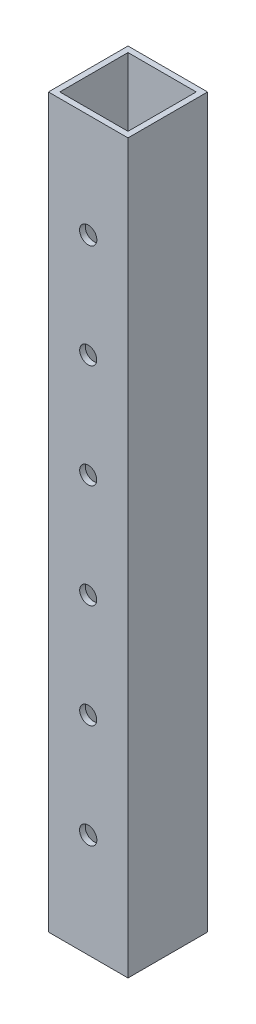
ISO-10303-21;
HEADER;
FILE_DESCRIPTION(('STEP AP214'),'2;1');
FILE_NAME('part.step','',(''),(''),'','','');
FILE_SCHEMA(('AUTOMOTIVE_DESIGN { 1 0 10303 214 1 1 1 1 }'));
ENDSEC;
DATA;
#1=APPLICATION_CONTEXT('core data for automotive mechanical design processes');
#2=APPLICATION_PROTOCOL_DEFINITION('international standard','automotive_design',2000,#1);
#3=PRODUCT_CONTEXT('',#1,'mechanical');
#4=PRODUCT('Part','Part','',(#3));
#5=PRODUCT_RELATED_PRODUCT_CATEGORY('part','',(#4));
#6=PRODUCT_DEFINITION_FORMATION('','',#4);
#7=PRODUCT_DEFINITION_CONTEXT('part definition',#1,'design');
#8=PRODUCT_DEFINITION('design','',#6,#7);
#9=PRODUCT_DEFINITION_SHAPE('','',#8);
#10=(LENGTH_UNIT() NAMED_UNIT(*) SI_UNIT(.MILLI.,.METRE.));
#11=(NAMED_UNIT(*) PLANE_ANGLE_UNIT() SI_UNIT($,.RADIAN.));
#12=(NAMED_UNIT(*) SI_UNIT($,.STERADIAN.) SOLID_ANGLE_UNIT());
#13=UNCERTAINTY_MEASURE_WITH_UNIT(LENGTH_MEASURE(1.E-05),#10,'distance_accuracy_value','');
#14=(GEOMETRIC_REPRESENTATION_CONTEXT(3) GLOBAL_UNCERTAINTY_ASSIGNED_CONTEXT((#13)) GLOBAL_UNIT_ASSIGNED_CONTEXT((#10,
#11,#12)) REPRESENTATION_CONTEXT('',''));
#15=CARTESIAN_POINT('',(0.,0.,0.));
#16=DIRECTION('',(0.,0.,1.));
#17=DIRECTION('',(1.,0.,0.));
#18=AXIS2_PLACEMENT_3D('',#15,#16,#17);
#19=CARTESIAN_POINT('',(-28.575,406.4,28.575));
#20=DIRECTION('',(0.,0.,-1.));
#21=DIRECTION('',(-1.,0.,0.));
#22=AXIS2_PLACEMENT_3D('',#19,#20,#21);
#23=PLANE('',#22);
#24=CARTESIAN_POINT('',(-6.35,58.0571428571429,28.575));
#25=DIRECTION('',(0.,0.,1.));
#26=DIRECTION('',(-1.,0.,0.));
#27=AXIS2_PLACEMENT_3D('',#24,#25,#26);
#28=CIRCLE('',#27,4.82600000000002);
#29=CARTESIAN_POINT('',(-11.176,58.0571428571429,28.575));
#30=VERTEX_POINT('',#29);
#31=EDGE_CURVE('E217',#30,#30,#28,.T.);
#32=ORIENTED_EDGE('',*,*,#31,.F.);
#33=EDGE_LOOP('',(#32));
#34=FACE_BOUND('',#33,.T.);
#35=DIRECTION('',(1.,0.,0.));
#36=VECTOR('',#35,1.);
#37=CARTESIAN_POINT('',(-28.575,0.,28.575));
#38=LINE('',#37,#36);
#39=CARTESIAN_POINT('',(-28.575,0.,28.575));
#40=VERTEX_POINT('',#39);
#41=CARTESIAN_POINT('',(15.875,0.,28.575));
#42=VERTEX_POINT('',#41);
#43=EDGE_CURVE('E184',#40,#42,#38,.T.);
#44=ORIENTED_EDGE('',*,*,#43,.T.);
#45=DIRECTION('',(0.,-1.,0.));
#46=VECTOR('',#45,1.);
#47=CARTESIAN_POINT('',(15.875,406.4,28.575));
#48=LINE('',#47,#46);
#49=CARTESIAN_POINT('',(15.875,406.4,28.575));
#50=VERTEX_POINT('',#49);
#51=EDGE_CURVE('E72',#50,#42,#48,.T.);
#52=ORIENTED_EDGE('',*,*,#51,.F.);
#53=DIRECTION('',(1.,0.,0.));
#54=VECTOR('',#53,1.);
#55=CARTESIAN_POINT('',(-28.575,406.4,28.575));
#56=LINE('',#55,#54);
#57=CARTESIAN_POINT('',(-28.575,406.4,28.575));
#58=VERTEX_POINT('',#57);
#59=EDGE_CURVE('E172',#58,#50,#56,.T.);
#60=ORIENTED_EDGE('',*,*,#59,.F.);
#61=DIRECTION('',(0.,-1.,0.));
#62=VECTOR('',#61,1.);
#63=CARTESIAN_POINT('',(-28.575,406.4,28.575));
#64=LINE('',#63,#62);
#65=EDGE_CURVE('E12',#58,#40,#64,.T.);
#66=ORIENTED_EDGE('',*,*,#65,.T.);
#67=EDGE_LOOP('',(#44,#52,#60,#66));
#68=FACE_BOUND('',#67,.T.);
#69=CARTESIAN_POINT('',(-6.35,290.285714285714,28.575));
#70=DIRECTION('',(0.,0.,-1.));
#71=DIRECTION('',(-1.,0.,0.));
#72=AXIS2_PLACEMENT_3D('',#69,#70,#71);
#73=CIRCLE('',#72,4.7625);
#74=CARTESIAN_POINT('',(-11.1125,290.285714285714,28.575));
#75=VERTEX_POINT('',#74);
#76=EDGE_CURVE('E199',#75,#75,#73,.T.);
#77=ORIENTED_EDGE('',*,*,#76,.T.);
#78=EDGE_LOOP('',(#77));
#79=FACE_BOUND('',#78,.T.);
#80=CARTESIAN_POINT('',(-6.35,348.342857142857,28.575));
#81=DIRECTION('',(0.,0.,-1.));
#82=DIRECTION('',(-1.,0.,0.));
#83=AXIS2_PLACEMENT_3D('',#80,#81,#82);
#84=CIRCLE('',#83,4.82600000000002);
#85=CARTESIAN_POINT('',(-11.176,348.342857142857,28.575));
#86=VERTEX_POINT('',#85);
#87=EDGE_CURVE('E204',#86,#86,#84,.T.);
#88=ORIENTED_EDGE('',*,*,#87,.T.);
#89=EDGE_LOOP('',(#88));
#90=FACE_BOUND('',#89,.T.);
#91=CARTESIAN_POINT('',(-6.35,232.228571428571,28.575));
#92=DIRECTION('',(0.,0.,-1.));
#93=DIRECTION('',(-1.,0.,0.));
#94=AXIS2_PLACEMENT_3D('',#91,#92,#93);
#95=CIRCLE('',#94,4.7625);
#96=CARTESIAN_POINT('',(-11.1125,232.228571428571,28.575));
#97=VERTEX_POINT('',#96);
#98=EDGE_CURVE('E209',#97,#97,#95,.T.);
#99=ORIENTED_EDGE('',*,*,#98,.T.);
#100=EDGE_LOOP('',(#99));
#101=FACE_BOUND('',#100,.T.);
#102=CARTESIAN_POINT('',(-6.35,116.114285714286,28.575));
#103=DIRECTION('',(0.,0.,1.));
#104=DIRECTION('',(-1.,0.,0.));
#105=AXIS2_PLACEMENT_3D('',#102,#103,#104);
#106=CIRCLE('',#105,4.7625);
#107=CARTESIAN_POINT('',(-11.1125,116.114285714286,28.575));
#108=VERTEX_POINT('',#107);
#109=EDGE_CURVE('E213',#108,#108,#106,.T.);
#110=ORIENTED_EDGE('',*,*,#109,.F.);
#111=EDGE_LOOP('',(#110));
#112=FACE_BOUND('',#111,.T.);
#113=CARTESIAN_POINT('',(-6.35,174.171428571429,28.575));
#114=DIRECTION('',(0.,0.,1.));
#115=DIRECTION('',(-1.,0.,0.));
#116=AXIS2_PLACEMENT_3D('',#113,#114,#115);
#117=CIRCLE('',#116,4.7625);
#118=CARTESIAN_POINT('',(-11.1125,174.171428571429,28.575));
#119=VERTEX_POINT('',#118);
#120=EDGE_CURVE('E277',#119,#119,#117,.T.);
#121=ORIENTED_EDGE('',*,*,#120,.F.);
#122=EDGE_LOOP('',(#121));
#123=FACE_BOUND('',#122,.T.);
#124=ADVANCED_FACE('F63',(#34,#68,#79,#90,#101,#112,#123),#23,.F.);
#125=CARTESIAN_POINT('',(-28.575,406.4,-15.875));
#126=DIRECTION('',(0.,0.,-1.));
#127=DIRECTION('',(-1.,0.,0.));
#128=AXIS2_PLACEMENT_3D('',#125,#126,#127);
#129=PLANE('',#128);
#130=CARTESIAN_POINT('',(-6.35,58.0571428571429,-15.875));
#131=DIRECTION('',(0.,0.,1.));
#132=DIRECTION('',(-1.,0.,0.));
#133=AXIS2_PLACEMENT_3D('',#130,#131,#132);
#134=CIRCLE('',#133,4.82600000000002);
#135=CARTESIAN_POINT('',(-11.176,58.0571428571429,-15.875));
#136=VERTEX_POINT('',#135);
#137=EDGE_CURVE('E224',#136,#136,#134,.T.);
#138=ORIENTED_EDGE('',*,*,#137,.T.);
#139=EDGE_LOOP('',(#138));
#140=FACE_BOUND('',#139,.T.);
#141=DIRECTION('',(1.,0.,0.));
#142=VECTOR('',#141,1.);
#143=CARTESIAN_POINT('',(-28.575,0.,-15.875));
#144=LINE('',#143,#142);
#145=CARTESIAN_POINT('',(-28.575,0.,-15.875));
#146=VERTEX_POINT('',#145);
#147=CARTESIAN_POINT('',(15.875,0.,-15.875));
#148=VERTEX_POINT('',#147);
#149=EDGE_CURVE('E173',#146,#148,#144,.T.);
#150=ORIENTED_EDGE('',*,*,#149,.F.);
#151=DIRECTION('',(0.,-1.,0.));
#152=VECTOR('',#151,1.);
#153=CARTESIAN_POINT('',(-28.575,406.4,-15.875));
#154=LINE('',#153,#152);
#155=CARTESIAN_POINT('',(-28.575,406.4,-15.875));
#156=VERTEX_POINT('',#155);
#157=EDGE_CURVE('E181',#156,#146,#154,.T.);
#158=ORIENTED_EDGE('',*,*,#157,.F.);
#159=DIRECTION('',(1.,0.,0.));
#160=VECTOR('',#159,1.);
#161=CARTESIAN_POINT('',(-28.575,406.4,-15.875));
#162=LINE('',#161,#160);
#163=CARTESIAN_POINT('',(15.875,406.4,-15.875));
#164=VERTEX_POINT('',#163);
#165=EDGE_CURVE('E178',#156,#164,#162,.T.);
#166=ORIENTED_EDGE('',*,*,#165,.T.);
#167=DIRECTION('',(0.,-1.,0.));
#168=VECTOR('',#167,1.);
#169=CARTESIAN_POINT('',(15.875,406.4,-15.875));
#170=LINE('',#169,#168);
#171=EDGE_CURVE('E193',#164,#148,#170,.T.);
#172=ORIENTED_EDGE('',*,*,#171,.T.);
#173=EDGE_LOOP('',(#150,#158,#166,#172));
#174=FACE_BOUND('',#173,.T.);
#175=CARTESIAN_POINT('',(-6.35,290.285714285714,-15.875));
#176=DIRECTION('',(0.,0.,-1.));
#177=DIRECTION('',(-1.,0.,0.));
#178=AXIS2_PLACEMENT_3D('',#175,#176,#177);
#179=CIRCLE('',#178,4.7625);
#180=CARTESIAN_POINT('',(-11.1125,290.285714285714,-15.875));
#181=VERTEX_POINT('',#180);
#182=EDGE_CURVE('E254',#181,#181,#179,.T.);
#183=ORIENTED_EDGE('',*,*,#182,.F.);
#184=EDGE_LOOP('',(#183));
#185=FACE_BOUND('',#184,.T.);
#186=CARTESIAN_POINT('',(-6.35,348.342857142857,-15.875));
#187=DIRECTION('',(0.,0.,-1.));
#188=DIRECTION('',(-1.,0.,0.));
#189=AXIS2_PLACEMENT_3D('',#186,#187,#188);
#190=CIRCLE('',#189,4.82600000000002);
#191=CARTESIAN_POINT('',(-11.176,348.342857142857,-15.875));
#192=VERTEX_POINT('',#191);
#193=EDGE_CURVE('E247',#192,#192,#190,.T.);
#194=ORIENTED_EDGE('',*,*,#193,.F.);
#195=EDGE_LOOP('',(#194));
#196=FACE_BOUND('',#195,.T.);
#197=CARTESIAN_POINT('',(-6.35,232.228571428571,-15.875));
#198=DIRECTION('',(0.,0.,-1.));
#199=DIRECTION('',(-1.,0.,0.));
#200=AXIS2_PLACEMENT_3D('',#197,#198,#199);
#201=CIRCLE('',#200,4.7625);
#202=CARTESIAN_POINT('',(-11.1125,232.228571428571,-15.875));
#203=VERTEX_POINT('',#202);
#204=EDGE_CURVE('E240',#203,#203,#201,.T.);
#205=ORIENTED_EDGE('',*,*,#204,.F.);
#206=EDGE_LOOP('',(#205));
#207=FACE_BOUND('',#206,.T.);
#208=CARTESIAN_POINT('',(-6.35,116.114285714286,-15.875));
#209=DIRECTION('',(0.,0.,1.));
#210=DIRECTION('',(-1.,0.,0.));
#211=AXIS2_PLACEMENT_3D('',#208,#209,#210);
#212=CIRCLE('',#211,4.7625);
#213=CARTESIAN_POINT('',(-11.1125,116.114285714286,-15.875));
#214=VERTEX_POINT('',#213);
#215=EDGE_CURVE('E221',#214,#214,#212,.T.);
#216=ORIENTED_EDGE('',*,*,#215,.T.);
#217=EDGE_LOOP('',(#216));
#218=FACE_BOUND('',#217,.T.);
#219=CARTESIAN_POINT('',(-6.35,174.171428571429,-15.875));
#220=DIRECTION('',(0.,0.,1.));
#221=DIRECTION('',(-1.,0.,0.));
#222=AXIS2_PLACEMENT_3D('',#219,#220,#221);
#223=CIRCLE('',#222,4.7625);
#224=CARTESIAN_POINT('',(-11.1125,174.171428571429,-15.875));
#225=VERTEX_POINT('',#224);
#226=EDGE_CURVE('E275',#225,#225,#223,.T.);
#227=ORIENTED_EDGE('',*,*,#226,.T.);
#228=EDGE_LOOP('',(#227));
#229=FACE_BOUND('',#228,.T.);
#230=ADVANCED_FACE('F262',(#140,#174,#185,#196,#207,#218,#229),#129,.T.);
#231=CARTESIAN_POINT('',(-25.4,406.4,-12.7));
#232=DIRECTION('',(0.,0.,-1.));
#233=DIRECTION('',(-1.,0.,0.));
#234=AXIS2_PLACEMENT_3D('',#231,#232,#233);
#235=PLANE('',#234);
#236=CARTESIAN_POINT('',(-6.35,58.0571428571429,-12.7));
#237=DIRECTION('',(0.,0.,-1.));
#238=DIRECTION('',(-1.,0.,0.));
#239=AXIS2_PLACEMENT_3D('',#236,#237,#238);
#240=CIRCLE('',#239,4.82600000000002);
#241=CARTESIAN_POINT('',(-11.176,58.0571428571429,-12.7));
#242=VERTEX_POINT('',#241);
#243=EDGE_CURVE('E216',#242,#242,#240,.F.);
#244=ORIENTED_EDGE('',*,*,#243,.F.);
#245=EDGE_LOOP('',(#244));
#246=FACE_BOUND('',#245,.T.);
#247=DIRECTION('',(1.,0.,0.));
#248=VECTOR('',#247,1.);
#249=CARTESIAN_POINT('',(-25.4,0.,-12.7));
#250=LINE('',#249,#248);
#251=CARTESIAN_POINT('',(-25.4,0.,-12.7));
#252=VERTEX_POINT('',#251);
#253=CARTESIAN_POINT('',(12.7,0.,-12.7));
#254=VERTEX_POINT('',#253);
#255=EDGE_CURVE('E88',#252,#254,#250,.T.);
#256=ORIENTED_EDGE('',*,*,#255,.T.);
#257=DIRECTION('',(0.,-1.,0.));
#258=VECTOR('',#257,1.);
#259=CARTESIAN_POINT('',(12.7,406.4,-12.7));
#260=LINE('',#259,#258);
#261=CARTESIAN_POINT('',(12.7,406.4,-12.7));
#262=VERTEX_POINT('',#261);
#263=EDGE_CURVE('E129',#262,#254,#260,.T.);
#264=ORIENTED_EDGE('',*,*,#263,.F.);
#265=DIRECTION('',(1.,0.,0.));
#266=VECTOR('',#265,1.);
#267=CARTESIAN_POINT('',(-25.4,406.4,-12.7));
#268=LINE('',#267,#266);
#269=CARTESIAN_POINT('',(-25.4,406.4,-12.7));
#270=VERTEX_POINT('',#269);
#271=EDGE_CURVE('E133',#270,#262,#268,.T.);
#272=ORIENTED_EDGE('',*,*,#271,.F.);
#273=DIRECTION('',(0.,-1.,0.));
#274=VECTOR('',#273,1.);
#275=CARTESIAN_POINT('',(-25.4,406.4,-12.7));
#276=LINE('',#275,#274);
#277=EDGE_CURVE('E163',#270,#252,#276,.T.);
#278=ORIENTED_EDGE('',*,*,#277,.T.);
#279=EDGE_LOOP('',(#256,#264,#272,#278));
#280=FACE_BOUND('',#279,.T.);
#281=CARTESIAN_POINT('',(-6.35,290.285714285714,-12.7));
#282=DIRECTION('',(0.,0.,-1.));
#283=DIRECTION('',(-1.,0.,0.));
#284=AXIS2_PLACEMENT_3D('',#281,#282,#283);
#285=CIRCLE('',#284,4.7625);
#286=CARTESIAN_POINT('',(-11.1125,290.285714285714,-12.7));
#287=VERTEX_POINT('',#286);
#288=EDGE_CURVE('E153',#287,#287,#285,.T.);
#289=ORIENTED_EDGE('',*,*,#288,.T.);
#290=EDGE_LOOP('',(#289));
#291=FACE_BOUND('',#290,.T.);
#292=CARTESIAN_POINT('',(-6.35,348.342857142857,-12.7));
#293=DIRECTION('',(0.,0.,-1.));
#294=DIRECTION('',(-1.,0.,0.));
#295=AXIS2_PLACEMENT_3D('',#292,#293,#294);
#296=CIRCLE('',#295,4.82600000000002);
#297=CARTESIAN_POINT('',(-11.176,348.342857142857,-12.7));
#298=VERTEX_POINT('',#297);
#299=EDGE_CURVE('E203',#298,#298,#296,.T.);
#300=ORIENTED_EDGE('',*,*,#299,.T.);
#301=EDGE_LOOP('',(#300));
#302=FACE_BOUND('',#301,.T.);
#303=CARTESIAN_POINT('',(-6.35,232.228571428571,-12.7));
#304=DIRECTION('',(0.,0.,-1.));
#305=DIRECTION('',(-1.,0.,0.));
#306=AXIS2_PLACEMENT_3D('',#303,#304,#305);
#307=CIRCLE('',#306,4.7625);
#308=CARTESIAN_POINT('',(-11.1125,232.228571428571,-12.7));
#309=VERTEX_POINT('',#308);
#310=EDGE_CURVE('E208',#309,#309,#307,.T.);
#311=ORIENTED_EDGE('',*,*,#310,.T.);
#312=EDGE_LOOP('',(#311));
#313=FACE_BOUND('',#312,.T.);
#314=CARTESIAN_POINT('',(-6.35,116.114285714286,-12.7));
#315=DIRECTION('',(0.,0.,-1.));
#316=DIRECTION('',(-1.,0.,0.));
#317=AXIS2_PLACEMENT_3D('',#314,#315,#316);
#318=CIRCLE('',#317,4.7625);
#319=CARTESIAN_POINT('',(-11.1125,116.114285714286,-12.7));
#320=VERTEX_POINT('',#319);
#321=EDGE_CURVE('E212',#320,#320,#318,.F.);
#322=ORIENTED_EDGE('',*,*,#321,.F.);
#323=EDGE_LOOP('',(#322));
#324=FACE_BOUND('',#323,.T.);
#325=CARTESIAN_POINT('',(-6.35,174.171428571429,-12.7));
#326=DIRECTION('',(0.,0.,-1.));
#327=DIRECTION('',(-1.,0.,0.));
#328=AXIS2_PLACEMENT_3D('',#325,#326,#327);
#329=CIRCLE('',#328,4.7625);
#330=CARTESIAN_POINT('',(-11.1125,174.171428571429,-12.7));
#331=VERTEX_POINT('',#330);
#332=EDGE_CURVE('E229',#331,#331,#329,.F.);
#333=ORIENTED_EDGE('',*,*,#332,.F.);
#334=EDGE_LOOP('',(#333));
#335=FACE_BOUND('',#334,.T.);
#336=ADVANCED_FACE('F130',(#246,#280,#291,#302,#313,#324,#335),#235,.F.);
#337=CARTESIAN_POINT('',(-25.4,406.4,25.4));
#338=DIRECTION('',(0.,0.,-1.));
#339=DIRECTION('',(-1.,0.,0.));
#340=AXIS2_PLACEMENT_3D('',#337,#338,#339);
#341=PLANE('',#340);
#342=CARTESIAN_POINT('',(-6.35,58.0571428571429,25.4));
#343=DIRECTION('',(0.,0.,-1.));
#344=DIRECTION('',(-1.,0.,0.));
#345=AXIS2_PLACEMENT_3D('',#342,#343,#344);
#346=CIRCLE('',#345,4.82600000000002);
#347=CARTESIAN_POINT('',(-11.176,58.0571428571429,25.4));
#348=VERTEX_POINT('',#347);
#349=EDGE_CURVE('E214',#348,#348,#346,.F.);
#350=ORIENTED_EDGE('',*,*,#349,.T.);
#351=EDGE_LOOP('',(#350));
#352=FACE_BOUND('',#351,.T.);
#353=DIRECTION('',(1.,0.,0.));
#354=VECTOR('',#353,1.);
#355=CARTESIAN_POINT('',(-25.4,0.,25.4));
#356=LINE('',#355,#354);
#357=CARTESIAN_POINT('',(-25.4,0.,25.4));
#358=VERTEX_POINT('',#357);
#359=CARTESIAN_POINT('',(12.7,0.,25.4));
#360=VERTEX_POINT('',#359);
#361=EDGE_CURVE('E150',#358,#360,#356,.T.);
#362=ORIENTED_EDGE('',*,*,#361,.F.);
#363=DIRECTION('',(0.,-1.,0.));
#364=VECTOR('',#363,1.);
#365=CARTESIAN_POINT('',(-25.4,406.4,25.4));
#366=LINE('',#365,#364);
#367=CARTESIAN_POINT('',(-25.4,406.4,25.4));
#368=VERTEX_POINT('',#367);
#369=EDGE_CURVE('E166',#368,#358,#366,.T.);
#370=ORIENTED_EDGE('',*,*,#369,.F.);
#371=DIRECTION('',(1.,0.,0.));
#372=VECTOR('',#371,1.);
#373=CARTESIAN_POINT('',(-25.4,406.4,25.4));
#374=LINE('',#373,#372);
#375=CARTESIAN_POINT('',(12.7,406.4,25.4));
#376=VERTEX_POINT('',#375);
#377=EDGE_CURVE('E143',#368,#376,#374,.T.);
#378=ORIENTED_EDGE('',*,*,#377,.T.);
#379=DIRECTION('',(0.,-1.,0.));
#380=VECTOR('',#379,1.);
#381=CARTESIAN_POINT('',(12.7,406.4,25.4));
#382=LINE('',#381,#380);
#383=EDGE_CURVE('E80',#376,#360,#382,.T.);
#384=ORIENTED_EDGE('',*,*,#383,.T.);
#385=EDGE_LOOP('',(#362,#370,#378,#384));
#386=FACE_BOUND('',#385,.T.);
#387=CARTESIAN_POINT('',(-6.35,290.285714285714,25.4));
#388=DIRECTION('',(0.,0.,-1.));
#389=DIRECTION('',(-1.,0.,0.));
#390=AXIS2_PLACEMENT_3D('',#387,#388,#389);
#391=CIRCLE('',#390,4.7625);
#392=CARTESIAN_POINT('',(-11.1125,290.285714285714,25.4));
#393=VERTEX_POINT('',#392);
#394=EDGE_CURVE('E196',#393,#393,#391,.T.);
#395=ORIENTED_EDGE('',*,*,#394,.F.);
#396=EDGE_LOOP('',(#395));
#397=FACE_BOUND('',#396,.T.);
#398=CARTESIAN_POINT('',(-6.35,348.342857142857,25.4));
#399=DIRECTION('',(0.,0.,-1.));
#400=DIRECTION('',(-1.,0.,0.));
#401=AXIS2_PLACEMENT_3D('',#398,#399,#400);
#402=CIRCLE('',#401,4.82600000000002);
#403=CARTESIAN_POINT('',(-11.176,348.342857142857,25.4));
#404=VERTEX_POINT('',#403);
#405=EDGE_CURVE('E200',#404,#404,#402,.T.);
#406=ORIENTED_EDGE('',*,*,#405,.F.);
#407=EDGE_LOOP('',(#406));
#408=FACE_BOUND('',#407,.T.);
#409=CARTESIAN_POINT('',(-6.35,232.228571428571,25.4));
#410=DIRECTION('',(0.,0.,-1.));
#411=DIRECTION('',(-1.,0.,0.));
#412=AXIS2_PLACEMENT_3D('',#409,#410,#411);
#413=CIRCLE('',#412,4.7625);
#414=CARTESIAN_POINT('',(-11.1125,232.228571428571,25.4));
#415=VERTEX_POINT('',#414);
#416=EDGE_CURVE('E205',#415,#415,#413,.T.);
#417=ORIENTED_EDGE('',*,*,#416,.F.);
#418=EDGE_LOOP('',(#417));
#419=FACE_BOUND('',#418,.T.);
#420=CARTESIAN_POINT('',(-6.35,116.114285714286,25.4));
#421=DIRECTION('',(0.,0.,-1.));
#422=DIRECTION('',(-1.,0.,0.));
#423=AXIS2_PLACEMENT_3D('',#420,#421,#422);
#424=CIRCLE('',#423,4.7625);
#425=CARTESIAN_POINT('',(-11.1125,116.114285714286,25.4));
#426=VERTEX_POINT('',#425);
#427=EDGE_CURVE('E210',#426,#426,#424,.F.);
#428=ORIENTED_EDGE('',*,*,#427,.T.);
#429=EDGE_LOOP('',(#428));
#430=FACE_BOUND('',#429,.T.);
#431=CARTESIAN_POINT('',(-6.35,174.171428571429,25.4));
#432=DIRECTION('',(0.,0.,-1.));
#433=DIRECTION('',(-1.,0.,0.));
#434=AXIS2_PLACEMENT_3D('',#431,#432,#433);
#435=CIRCLE('',#434,4.7625);
#436=CARTESIAN_POINT('',(-11.1125,174.171428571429,25.4));
#437=VERTEX_POINT('',#436);
#438=EDGE_CURVE('E67',#437,#437,#435,.F.);
#439=ORIENTED_EDGE('',*,*,#438,.T.);
#440=EDGE_LOOP('',(#439));
#441=FACE_BOUND('',#440,.T.);
#442=ADVANCED_FACE('F291',(#352,#386,#397,#408,#419,#430,#441),#341,.T.);
#443=CARTESIAN_POINT('',(-28.575,406.4,-15.875));
#444=DIRECTION('',(1.,0.,0.));
#445=DIRECTION('',(0.,0.,-1.));
#446=AXIS2_PLACEMENT_3D('',#443,#444,#445);
#447=PLANE('',#446);
#448=DIRECTION('',(0.,0.,1.));
#449=VECTOR('',#448,1.);
#450=CARTESIAN_POINT('',(-28.575,0.,-15.875));
#451=LINE('',#450,#449);
#452=EDGE_CURVE('E165',#146,#40,#451,.T.);
#453=ORIENTED_EDGE('',*,*,#452,.T.);
#454=ORIENTED_EDGE('',*,*,#65,.F.);
#455=DIRECTION('',(0.,0.,1.));
#456=VECTOR('',#455,1.);
#457=CARTESIAN_POINT('',(-28.575,406.4,-15.875));
#458=LINE('',#457,#456);
#459=EDGE_CURVE('E169',#156,#58,#458,.T.);
#460=ORIENTED_EDGE('',*,*,#459,.F.);
#461=ORIENTED_EDGE('',*,*,#157,.T.);
#462=EDGE_LOOP('',(#453,#454,#460,#461));
#463=FACE_BOUND('',#462,.T.);
#464=ADVANCED_FACE('F65',(#463),#447,.F.);
#465=CARTESIAN_POINT('',(15.875,406.4,-15.875));
#466=DIRECTION('',(1.,0.,0.));
#467=DIRECTION('',(0.,0.,-1.));
#468=AXIS2_PLACEMENT_3D('',#465,#466,#467);
#469=PLANE('',#468);
#470=DIRECTION('',(0.,0.,1.));
#471=VECTOR('',#470,1.);
#472=CARTESIAN_POINT('',(15.875,0.,-15.875));
#473=LINE('',#472,#471);
#474=EDGE_CURVE('E187',#148,#42,#473,.T.);
#475=ORIENTED_EDGE('',*,*,#474,.F.);
#476=ORIENTED_EDGE('',*,*,#171,.F.);
#477=DIRECTION('',(0.,0.,1.));
#478=VECTOR('',#477,1.);
#479=CARTESIAN_POINT('',(15.875,406.4,-15.875));
#480=LINE('',#479,#478);
#481=EDGE_CURVE('E175',#164,#50,#480,.T.);
#482=ORIENTED_EDGE('',*,*,#481,.T.);
#483=ORIENTED_EDGE('',*,*,#51,.T.);
#484=EDGE_LOOP('',(#475,#476,#482,#483));
#485=FACE_BOUND('',#484,.T.);
#486=ADVANCED_FACE('F307',(#485),#469,.T.);
#487=CARTESIAN_POINT('',(0.,406.4,0.));
#488=DIRECTION('',(0.,1.,0.));
#489=DIRECTION('',(0.,0.,1.));
#490=AXIS2_PLACEMENT_3D('',#487,#488,#489);
#491=PLANE('',#490);
#492=ORIENTED_EDGE('',*,*,#271,.T.);
#493=DIRECTION('',(0.,0.,1.));
#494=VECTOR('',#493,1.);
#495=CARTESIAN_POINT('',(12.7,406.4,-12.7));
#496=LINE('',#495,#494);
#497=EDGE_CURVE('E139',#262,#376,#496,.T.);
#498=ORIENTED_EDGE('',*,*,#497,.T.);
#499=ORIENTED_EDGE('',*,*,#377,.F.);
#500=DIRECTION('',(0.,0.,1.));
#501=VECTOR('',#500,1.);
#502=CARTESIAN_POINT('',(-25.4,406.4,-12.7));
#503=LINE('',#502,#501);
#504=EDGE_CURVE('E136',#270,#368,#503,.T.);
#505=ORIENTED_EDGE('',*,*,#504,.F.);
#506=EDGE_LOOP('',(#492,#498,#499,#505));
#507=FACE_BOUND('',#506,.T.);
#508=ORIENTED_EDGE('',*,*,#459,.T.);
#509=ORIENTED_EDGE('',*,*,#59,.T.);
#510=ORIENTED_EDGE('',*,*,#481,.F.);
#511=ORIENTED_EDGE('',*,*,#165,.F.);
#512=EDGE_LOOP('',(#508,#509,#510,#511));
#513=FACE_BOUND('',#512,.T.);
#514=ADVANCED_FACE('F145',(#507,#513),#491,.T.);
#515=CARTESIAN_POINT('',(0.,0.,0.));
#516=DIRECTION('',(0.,1.,0.));
#517=DIRECTION('',(0.,0.,1.));
#518=AXIS2_PLACEMENT_3D('',#515,#516,#517);
#519=PLANE('',#518);
#520=DIRECTION('',(0.,0.,1.));
#521=VECTOR('',#520,1.);
#522=CARTESIAN_POINT('',(12.7,0.,-12.7));
#523=LINE('',#522,#521);
#524=EDGE_CURVE('E159',#254,#360,#523,.T.);
#525=ORIENTED_EDGE('',*,*,#524,.F.);
#526=ORIENTED_EDGE('',*,*,#255,.F.);
#527=DIRECTION('',(0.,0.,1.));
#528=VECTOR('',#527,1.);
#529=CARTESIAN_POINT('',(-25.4,0.,-12.7));
#530=LINE('',#529,#528);
#531=EDGE_CURVE('E147',#252,#358,#530,.T.);
#532=ORIENTED_EDGE('',*,*,#531,.T.);
#533=ORIENTED_EDGE('',*,*,#361,.T.);
#534=EDGE_LOOP('',(#525,#526,#532,#533));
#535=FACE_BOUND('',#534,.T.);
#536=ORIENTED_EDGE('',*,*,#452,.F.);
#537=ORIENTED_EDGE('',*,*,#149,.T.);
#538=ORIENTED_EDGE('',*,*,#474,.T.);
#539=ORIENTED_EDGE('',*,*,#43,.F.);
#540=EDGE_LOOP('',(#536,#537,#538,#539));
#541=FACE_BOUND('',#540,.T.);
#542=ADVANCED_FACE('F311',(#535,#541),#519,.F.);
#543=CARTESIAN_POINT('',(-25.4,406.4,-12.7));
#544=DIRECTION('',(1.,0.,0.));
#545=DIRECTION('',(0.,0.,-1.));
#546=AXIS2_PLACEMENT_3D('',#543,#544,#545);
#547=PLANE('',#546);
#548=ORIENTED_EDGE('',*,*,#531,.F.);
#549=ORIENTED_EDGE('',*,*,#277,.F.);
#550=ORIENTED_EDGE('',*,*,#504,.T.);
#551=ORIENTED_EDGE('',*,*,#369,.T.);
#552=EDGE_LOOP('',(#548,#549,#550,#551));
#553=FACE_BOUND('',#552,.T.);
#554=ADVANCED_FACE('F313',(#553),#547,.T.);
#555=CARTESIAN_POINT('',(12.7,406.4,-12.7));
#556=DIRECTION('',(1.,0.,0.));
#557=DIRECTION('',(0.,0.,-1.));
#558=AXIS2_PLACEMENT_3D('',#555,#556,#557);
#559=PLANE('',#558);
#560=ORIENTED_EDGE('',*,*,#524,.T.);
#561=ORIENTED_EDGE('',*,*,#383,.F.);
#562=ORIENTED_EDGE('',*,*,#497,.F.);
#563=ORIENTED_EDGE('',*,*,#263,.T.);
#564=EDGE_LOOP('',(#560,#561,#562,#563));
#565=FACE_BOUND('',#564,.T.);
#566=ADVANCED_FACE('F140',(#565),#559,.F.);
#567=CARTESIAN_POINT('',(-6.35,290.285714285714,28.575));
#568=DIRECTION('',(0.,0.,-1.));
#569=DIRECTION('',(-1.,0.,0.));
#570=AXIS2_PLACEMENT_3D('',#567,#568,#569);
#571=CYLINDRICAL_SURFACE('',#570,4.7625);
#572=ORIENTED_EDGE('',*,*,#394,.T.);
#573=EDGE_LOOP('',(#572));
#574=FACE_BOUND('',#573,.T.);
#575=ORIENTED_EDGE('',*,*,#76,.F.);
#576=EDGE_LOOP('',(#575));
#577=FACE_BOUND('',#576,.T.);
#578=ADVANCED_FACE('F338',(#574,#577),#571,.F.);
#579=ORIENTED_EDGE('',*,*,#182,.T.);
#580=EDGE_LOOP('',(#579));
#581=FACE_BOUND('',#580,.T.);
#582=ORIENTED_EDGE('',*,*,#288,.F.);
#583=EDGE_LOOP('',(#582));
#584=FACE_BOUND('',#583,.T.);
#585=ADVANCED_FACE('F259',(#581,#584),#571,.F.);
#586=CARTESIAN_POINT('',(-6.35,348.342857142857,28.575));
#587=DIRECTION('',(0.,0.,-1.));
#588=DIRECTION('',(-1.,0.,0.));
#589=AXIS2_PLACEMENT_3D('',#586,#587,#588);
#590=CYLINDRICAL_SURFACE('',#589,4.82600000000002);
#591=ORIENTED_EDGE('',*,*,#405,.T.);
#592=EDGE_LOOP('',(#591));
#593=FACE_BOUND('',#592,.T.);
#594=ORIENTED_EDGE('',*,*,#87,.F.);
#595=EDGE_LOOP('',(#594));
#596=FACE_BOUND('',#595,.T.);
#597=ADVANCED_FACE('F351',(#593,#596),#590,.F.);
#598=ORIENTED_EDGE('',*,*,#193,.T.);
#599=EDGE_LOOP('',(#598));
#600=FACE_BOUND('',#599,.T.);
#601=ORIENTED_EDGE('',*,*,#299,.F.);
#602=EDGE_LOOP('',(#601));
#603=FACE_BOUND('',#602,.T.);
#604=ADVANCED_FACE('F357',(#600,#603),#590,.F.);
#605=CARTESIAN_POINT('',(-6.35,232.228571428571,28.575));
#606=DIRECTION('',(0.,0.,-1.));
#607=DIRECTION('',(-1.,0.,0.));
#608=AXIS2_PLACEMENT_3D('',#605,#606,#607);
#609=CYLINDRICAL_SURFACE('',#608,4.7625);
#610=ORIENTED_EDGE('',*,*,#416,.T.);
#611=EDGE_LOOP('',(#610));
#612=FACE_BOUND('',#611,.T.);
#613=ORIENTED_EDGE('',*,*,#98,.F.);
#614=EDGE_LOOP('',(#613));
#615=FACE_BOUND('',#614,.T.);
#616=ADVANCED_FACE('F365',(#612,#615),#609,.F.);
#617=ORIENTED_EDGE('',*,*,#204,.T.);
#618=EDGE_LOOP('',(#617));
#619=FACE_BOUND('',#618,.T.);
#620=ORIENTED_EDGE('',*,*,#310,.F.);
#621=EDGE_LOOP('',(#620));
#622=FACE_BOUND('',#621,.T.);
#623=ADVANCED_FACE('F372',(#619,#622),#609,.F.);
#624=CARTESIAN_POINT('',(-6.35,116.114285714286,28.575));
#625=DIRECTION('',(0.,0.,-1.));
#626=DIRECTION('',(-1.,0.,0.));
#627=AXIS2_PLACEMENT_3D('',#624,#625,#626);
#628=CYLINDRICAL_SURFACE('',#627,4.7625);
#629=ORIENTED_EDGE('',*,*,#427,.F.);
#630=EDGE_LOOP('',(#629));
#631=FACE_BOUND('',#630,.T.);
#632=ORIENTED_EDGE('',*,*,#109,.T.);
#633=EDGE_LOOP('',(#632));
#634=FACE_BOUND('',#633,.T.);
#635=ADVANCED_FACE('F380',(#631,#634),#628,.F.);
#636=ORIENTED_EDGE('',*,*,#215,.F.);
#637=EDGE_LOOP('',(#636));
#638=FACE_BOUND('',#637,.T.);
#639=ORIENTED_EDGE('',*,*,#321,.T.);
#640=EDGE_LOOP('',(#639));
#641=FACE_BOUND('',#640,.T.);
#642=ADVANCED_FACE('F387',(#638,#641),#628,.F.);
#643=CARTESIAN_POINT('',(-6.35,58.0571428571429,28.575));
#644=DIRECTION('',(0.,0.,-1.));
#645=DIRECTION('',(-1.,0.,0.));
#646=AXIS2_PLACEMENT_3D('',#643,#644,#645);
#647=CYLINDRICAL_SURFACE('',#646,4.82600000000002);
#648=ORIENTED_EDGE('',*,*,#349,.F.);
#649=EDGE_LOOP('',(#648));
#650=FACE_BOUND('',#649,.T.);
#651=ORIENTED_EDGE('',*,*,#31,.T.);
#652=EDGE_LOOP('',(#651));
#653=FACE_BOUND('',#652,.T.);
#654=ADVANCED_FACE('F396',(#650,#653),#647,.F.);
#655=ORIENTED_EDGE('',*,*,#137,.F.);
#656=EDGE_LOOP('',(#655));
#657=FACE_BOUND('',#656,.T.);
#658=ORIENTED_EDGE('',*,*,#243,.T.);
#659=EDGE_LOOP('',(#658));
#660=FACE_BOUND('',#659,.T.);
#661=ADVANCED_FACE('F403',(#657,#660),#647,.F.);
#662=CARTESIAN_POINT('',(-6.35,174.171428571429,28.575));
#663=DIRECTION('',(0.,0.,-1.));
#664=DIRECTION('',(-1.,0.,0.));
#665=AXIS2_PLACEMENT_3D('',#662,#663,#664);
#666=CYLINDRICAL_SURFACE('',#665,4.7625);
#667=ORIENTED_EDGE('',*,*,#438,.F.);
#668=EDGE_LOOP('',(#667));
#669=FACE_BOUND('',#668,.T.);
#670=ORIENTED_EDGE('',*,*,#120,.T.);
#671=EDGE_LOOP('',(#670));
#672=FACE_BOUND('',#671,.T.);
#673=ADVANCED_FACE('F411',(#669,#672),#666,.F.);
#674=ORIENTED_EDGE('',*,*,#226,.F.);
#675=EDGE_LOOP('',(#674));
#676=FACE_BOUND('',#675,.T.);
#677=ORIENTED_EDGE('',*,*,#332,.T.);
#678=EDGE_LOOP('',(#677));
#679=FACE_BOUND('',#678,.T.);
#680=ADVANCED_FACE('F288',(#676,#679),#666,.F.);
#681=CLOSED_SHELL('',(#124,#230,#336,#442,#464,#486,#514,#542,#554,#566,#578,#585,#597,#604,
#616,#623,#635,#642,#654,#661,#673,#680));
#682=MANIFOLD_SOLID_BREP('B2',#681);
#683=ADVANCED_BREP_SHAPE_REPRESENTATION('',(#18,#682),#14);
#684=SHAPE_DEFINITION_REPRESENTATION(#9,#683);
ENDSEC;
END-ISO-10303-21;
